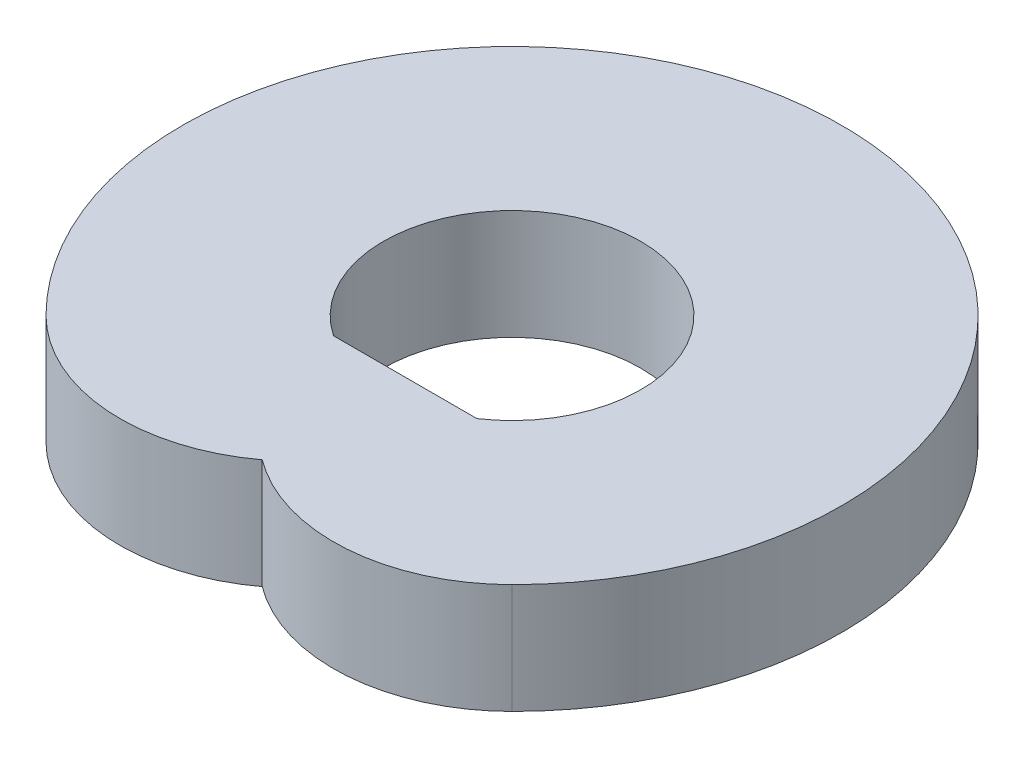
from build123d import *

# Parameters (mm, degrees)
EXTRUDE_1_DEPTH = 200


with BuildPart() as part:
    # Sketch 1 → Extrude 1 (new body)
    with BuildSketch(Plane(origin=(0, 0, 0), x_dir=(1, 0, 0), z_dir=(0, 1, 0))):
        with BuildLine():
            ThreePointArc((424.264068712, -424.264068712), (0, 600), (-424.264068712, -424.264068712))
            ThreePointArc((-424.264068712, -424.264068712), (-217.833180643, -518.612398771), (0, -454.862698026))
            ThreePointArc((0, -454.862698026), (217.833180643, -518.612398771), (424.264068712, -424.264068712))
        make_face()
        with BuildLine():
            Line((130.545635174, -194.454364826), (-130.545635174, -194.454364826))
            ThreePointArc((-130.545635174, -194.454364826), (0, 234.210723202), (130.545635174, -194.454364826))
        make_face(mode=Mode.SUBTRACT)
    extrude(amount=EXTRUDE_1_DEPTH)


solid = part.part
